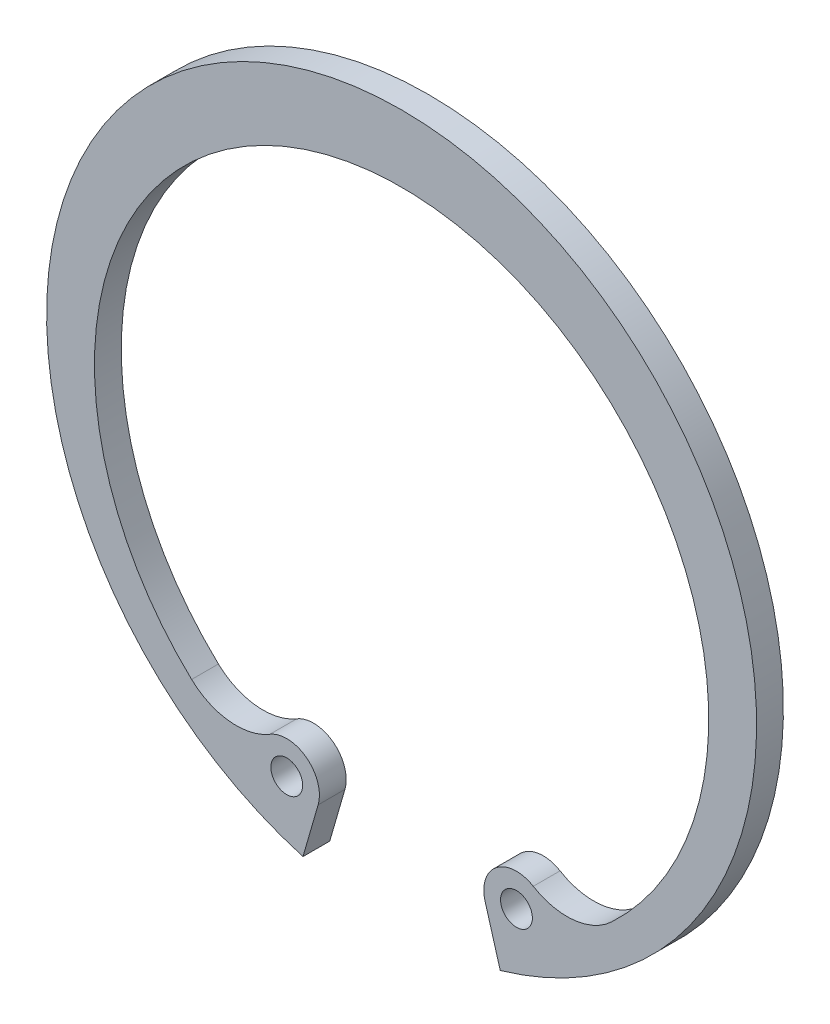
ISO-10303-21;
HEADER;
FILE_DESCRIPTION(('STEP AP214'),'2;1');
FILE_NAME('part.step','',(''),(''),'','','');
FILE_SCHEMA(('AUTOMOTIVE_DESIGN { 1 0 10303 214 1 1 1 1 }'));
ENDSEC;
DATA;
#1=APPLICATION_CONTEXT('core data for automotive mechanical design processes');
#2=APPLICATION_PROTOCOL_DEFINITION('international standard','automotive_design',2000,#1);
#3=PRODUCT_CONTEXT('',#1,'mechanical');
#4=PRODUCT('Part','Part','',(#3));
#5=PRODUCT_RELATED_PRODUCT_CATEGORY('part','',(#4));
#6=PRODUCT_DEFINITION_FORMATION('','',#4);
#7=PRODUCT_DEFINITION_CONTEXT('part definition',#1,'design');
#8=PRODUCT_DEFINITION('design','',#6,#7);
#9=PRODUCT_DEFINITION_SHAPE('','',#8);
#10=(LENGTH_UNIT() NAMED_UNIT(*) SI_UNIT(.MILLI.,.METRE.));
#11=(NAMED_UNIT(*) PLANE_ANGLE_UNIT() SI_UNIT($,.RADIAN.));
#12=(NAMED_UNIT(*) SI_UNIT($,.STERADIAN.) SOLID_ANGLE_UNIT());
#13=UNCERTAINTY_MEASURE_WITH_UNIT(LENGTH_MEASURE(1.E-05),#10,'distance_accuracy_value','');
#14=(GEOMETRIC_REPRESENTATION_CONTEXT(3) GLOBAL_UNCERTAINTY_ASSIGNED_CONTEXT((#13)) GLOBAL_UNIT_ASSIGNED_CONTEXT((#10,
#11,#12)) REPRESENTATION_CONTEXT('',''));
#15=CARTESIAN_POINT('',(0.,0.,0.));
#16=DIRECTION('',(0.,0.,1.));
#17=DIRECTION('',(1.,0.,0.));
#18=AXIS2_PLACEMENT_3D('',#15,#16,#17);
#19=CARTESIAN_POINT('',(0.,0.,-1.6));
#20=DIRECTION('',(0.,0.,1.));
#21=DIRECTION('',(1.,0.,0.));
#22=AXIS2_PLACEMENT_3D('',#19,#20,#21);
#23=CYLINDRICAL_SURFACE('',#22,21.2);
#24=CARTESIAN_POINT('',(0.,0.,0.));
#25=DIRECTION('',(0.,0.,1.));
#26=DIRECTION('',(1.,0.,0.));
#27=AXIS2_PLACEMENT_3D('',#24,#25,#26);
#28=CIRCLE('',#27,21.2);
#29=CARTESIAN_POINT('',(5.89047248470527,-20.365223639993,0.));
#30=VERTEX_POINT('',#29);
#31=CARTESIAN_POINT('',(-5.89047248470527,-20.365223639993,0.));
#32=VERTEX_POINT('',#31);
#33=EDGE_CURVE('E96',#30,#32,#28,.T.);
#34=ORIENTED_EDGE('',*,*,#33,.F.);
#35=DIRECTION('',(0.,0.,1.));
#36=VECTOR('',#35,1.);
#37=CARTESIAN_POINT('',(5.89047248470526,-20.365223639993,-1.6));
#38=LINE('',#37,#36);
#39=CARTESIAN_POINT('',(5.89047248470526,-20.365223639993,-1.6));
#40=VERTEX_POINT('',#39);
#41=EDGE_CURVE('E11',#40,#30,#38,.T.);
#42=ORIENTED_EDGE('',*,*,#41,.F.);
#43=CARTESIAN_POINT('',(0.,0.,-1.6));
#44=DIRECTION('',(0.,0.,1.));
#45=DIRECTION('',(1.,0.,0.));
#46=AXIS2_PLACEMENT_3D('',#43,#44,#45);
#47=CIRCLE('',#46,21.2);
#48=CARTESIAN_POINT('',(-5.89047248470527,-20.365223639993,-1.6));
#49=VERTEX_POINT('',#48);
#50=EDGE_CURVE('E98',#40,#49,#47,.T.);
#51=ORIENTED_EDGE('',*,*,#50,.T.);
#52=DIRECTION('',(0.,0.,1.));
#53=VECTOR('',#52,1.);
#54=CARTESIAN_POINT('',(-5.89047248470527,-20.365223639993,-1.6));
#55=LINE('',#54,#53);
#56=EDGE_CURVE('E35',#49,#32,#55,.T.);
#57=ORIENTED_EDGE('',*,*,#56,.T.);
#58=EDGE_LOOP('',(#34,#42,#51,#57));
#59=FACE_BOUND('',#58,.T.);
#60=ADVANCED_FACE('F32',(#59),#23,.T.);
#61=CARTESIAN_POINT('',(5.89047248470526,-20.365223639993,-1.6));
#62=DIRECTION('',(-0.960623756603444,-0.277852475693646,0.));
#63=DIRECTION('',(0.277852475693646,-0.960623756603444,0.));
#64=AXIS2_PLACEMENT_3D('',#61,#62,#63);
#65=PLANE('',#64);
#66=DIRECTION('',(0.277852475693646,-0.960623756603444,0.));
#67=VECTOR('',#66,1.);
#68=CARTESIAN_POINT('',(5.89047248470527,-20.365223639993,0.));
#69=LINE('',#68,#67);
#70=CARTESIAN_POINT('',(4.98588441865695,-17.2377770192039,0.));
#71=VERTEX_POINT('',#70);
#72=EDGE_CURVE('E114',#71,#30,#69,.T.);
#73=ORIENTED_EDGE('',*,*,#72,.F.);
#74=DIRECTION('',(0.,0.,1.));
#75=VECTOR('',#74,1.);
#76=CARTESIAN_POINT('',(4.98588441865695,-17.2377770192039,-1.6));
#77=LINE('',#76,#75);
#78=CARTESIAN_POINT('',(4.98588441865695,-17.2377770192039,-1.6));
#79=VERTEX_POINT('',#78);
#80=EDGE_CURVE('E40',#79,#71,#77,.T.);
#81=ORIENTED_EDGE('',*,*,#80,.F.);
#82=DIRECTION('',(0.277852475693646,-0.960623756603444,0.));
#83=VECTOR('',#82,1.);
#84=CARTESIAN_POINT('',(5.89047248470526,-20.365223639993,-1.6));
#85=LINE('',#84,#83);
#86=EDGE_CURVE('E103',#79,#40,#85,.T.);
#87=ORIENTED_EDGE('',*,*,#86,.T.);
#88=ORIENTED_EDGE('',*,*,#41,.T.);
#89=EDGE_LOOP('',(#73,#81,#87,#88));
#90=FACE_BOUND('',#89,.T.);
#91=ADVANCED_FACE('F180',(#90),#65,.T.);
#92=CARTESIAN_POINT('',(6.85910074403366,-16.6959646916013,-1.6));
#93=DIRECTION('',(0.,0.,1.));
#94=DIRECTION('',(1.,0.,0.));
#95=AXIS2_PLACEMENT_3D('',#92,#93,#94);
#96=CYLINDRICAL_SURFACE('',#95,1.95);
#97=CARTESIAN_POINT('',(6.85910074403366,-16.6959646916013,0.));
#98=DIRECTION('',(0.,0.,1.));
#99=DIRECTION('',(1.,0.,0.));
#100=AXIS2_PLACEMENT_3D('',#97,#98,#99);
#101=CIRCLE('',#100,1.95);
#102=CARTESIAN_POINT('',(7.86393036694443,-15.0247922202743,0.));
#103=VERTEX_POINT('',#102);
#104=EDGE_CURVE('E132',#103,#71,#101,.T.);
#105=ORIENTED_EDGE('',*,*,#104,.F.);
#106=DIRECTION('',(0.,0.,1.));
#107=VECTOR('',#106,1.);
#108=CARTESIAN_POINT('',(7.86393036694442,-15.0247922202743,-1.6));
#109=LINE('',#108,#107);
#110=CARTESIAN_POINT('',(7.86393036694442,-15.0247922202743,-1.6));
#111=VERTEX_POINT('',#110);
#112=EDGE_CURVE('E154',#111,#103,#109,.T.);
#113=ORIENTED_EDGE('',*,*,#112,.F.);
#114=CARTESIAN_POINT('',(6.85910074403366,-16.6959646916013,-1.6));
#115=DIRECTION('',(0.,0.,1.));
#116=DIRECTION('',(1.,0.,0.));
#117=AXIS2_PLACEMENT_3D('',#114,#115,#116);
#118=CIRCLE('',#117,1.95);
#119=EDGE_CURVE('E150',#111,#79,#118,.T.);
#120=ORIENTED_EDGE('',*,*,#119,.T.);
#121=ORIENTED_EDGE('',*,*,#80,.T.);
#122=EDGE_LOOP('',(#105,#113,#120,#121));
#123=FACE_BOUND('',#122,.T.);
#124=ADVANCED_FACE('F179',(#123),#96,.T.);
#125=CARTESIAN_POINT('',(9.87358961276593,-11.6824472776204,-1.6));
#126=DIRECTION('',(0.,0.,1.));
#127=DIRECTION('',(1.,0.,0.));
#128=AXIS2_PLACEMENT_3D('',#125,#126,#127);
#129=CYLINDRICAL_SURFACE('',#128,3.9);
#130=CARTESIAN_POINT('',(9.87358961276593,-11.6824472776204,0.));
#131=DIRECTION('',(0.,0.,-1.));
#132=DIRECTION('',(1.,0.,0.));
#133=AXIS2_PLACEMENT_3D('',#130,#131,#132);
#134=CIRCLE('',#133,3.9);
#135=CARTESIAN_POINT('',(12.5398456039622,-14.5286867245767,0.));
#136=VERTEX_POINT('',#135);
#137=EDGE_CURVE('E129',#136,#103,#134,.T.);
#138=ORIENTED_EDGE('',*,*,#137,.F.);
#139=DIRECTION('',(0.,0.,1.));
#140=VECTOR('',#139,1.);
#141=CARTESIAN_POINT('',(12.5398456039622,-14.5286867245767,-1.59999999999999));
#142=LINE('',#141,#140);
#143=CARTESIAN_POINT('',(12.5398456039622,-14.5286867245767,-1.59999999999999));
#144=VERTEX_POINT('',#143);
#145=EDGE_CURVE('E156',#144,#136,#142,.T.);
#146=ORIENTED_EDGE('',*,*,#145,.F.);
#147=CARTESIAN_POINT('',(9.87358961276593,-11.6824472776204,-1.6));
#148=DIRECTION('',(0.,0.,-1.));
#149=DIRECTION('',(1.,0.,0.));
#150=AXIS2_PLACEMENT_3D('',#147,#148,#149);
#151=CIRCLE('',#150,3.9);
#152=EDGE_CURVE('E147',#144,#111,#151,.T.);
#153=ORIENTED_EDGE('',*,*,#152,.T.);
#154=ORIENTED_EDGE('',*,*,#112,.T.);
#155=EDGE_LOOP('',(#138,#146,#153,#154));
#156=FACE_BOUND('',#155,.T.);
#157=ADVANCED_FACE('F175',(#156),#129,.F.);
#158=CARTESIAN_POINT('',(0.,-1.14234897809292,-1.6));
#159=DIRECTION('',(0.,0.,1.));
#160=DIRECTION('',(1.,0.,0.));
#161=AXIS2_PLACEMENT_3D('',#158,#159,#160);
#162=CYLINDRICAL_SURFACE('',#161,18.3423489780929);
#163=CARTESIAN_POINT('',(0.,-1.14234897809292,0.));
#164=DIRECTION('',(0.,0.,-1.));
#165=DIRECTION('',(1.,0.,0.));
#166=AXIS2_PLACEMENT_3D('',#163,#164,#165);
#167=CIRCLE('',#166,18.3423489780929);
#168=CARTESIAN_POINT('',(-12.5398456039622,-14.5286867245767,0.));
#169=VERTEX_POINT('',#168);
#170=EDGE_CURVE('E126',#169,#136,#167,.T.);
#171=ORIENTED_EDGE('',*,*,#170,.F.);
#172=DIRECTION('',(0.,0.,1.));
#173=VECTOR('',#172,1.);
#174=CARTESIAN_POINT('',(-12.5398456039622,-14.5286867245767,-1.6));
#175=LINE('',#174,#173);
#176=CARTESIAN_POINT('',(-12.5398456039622,-14.5286867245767,-1.6));
#177=VERTEX_POINT('',#176);
#178=EDGE_CURVE('E158',#177,#169,#175,.T.);
#179=ORIENTED_EDGE('',*,*,#178,.F.);
#180=CARTESIAN_POINT('',(0.,-1.14234897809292,-1.6));
#181=DIRECTION('',(0.,0.,-1.));
#182=DIRECTION('',(1.,0.,0.));
#183=AXIS2_PLACEMENT_3D('',#180,#181,#182);
#184=CIRCLE('',#183,18.3423489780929);
#185=EDGE_CURVE('E144',#177,#144,#184,.T.);
#186=ORIENTED_EDGE('',*,*,#185,.T.);
#187=ORIENTED_EDGE('',*,*,#145,.T.);
#188=EDGE_LOOP('',(#171,#179,#186,#187));
#189=FACE_BOUND('',#188,.T.);
#190=ADVANCED_FACE('F171',(#189),#162,.F.);
#191=CARTESIAN_POINT('',(-9.87358961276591,-11.6824472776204,-1.6));
#192=DIRECTION('',(0.,0.,1.));
#193=DIRECTION('',(1.,0.,0.));
#194=AXIS2_PLACEMENT_3D('',#191,#192,#193);
#195=CYLINDRICAL_SURFACE('',#194,3.9);
#196=CARTESIAN_POINT('',(-9.87358961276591,-11.6824472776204,0.));
#197=DIRECTION('',(0.,0.,-1.));
#198=DIRECTION('',(1.,0.,0.));
#199=AXIS2_PLACEMENT_3D('',#196,#197,#198);
#200=CIRCLE('',#199,3.9);
#201=CARTESIAN_POINT('',(-7.86393036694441,-15.0247922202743,0.));
#202=VERTEX_POINT('',#201);
#203=EDGE_CURVE('E123',#202,#169,#200,.T.);
#204=ORIENTED_EDGE('',*,*,#203,.F.);
#205=DIRECTION('',(0.,0.,1.));
#206=VECTOR('',#205,1.);
#207=CARTESIAN_POINT('',(-7.86393036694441,-15.0247922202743,-1.59999999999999));
#208=LINE('',#207,#206);
#209=CARTESIAN_POINT('',(-7.86393036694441,-15.0247922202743,-1.59999999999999));
#210=VERTEX_POINT('',#209);
#211=EDGE_CURVE('E160',#210,#202,#208,.T.);
#212=ORIENTED_EDGE('',*,*,#211,.F.);
#213=CARTESIAN_POINT('',(-9.87358961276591,-11.6824472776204,-1.6));
#214=DIRECTION('',(0.,0.,-1.));
#215=DIRECTION('',(1.,0.,0.));
#216=AXIS2_PLACEMENT_3D('',#213,#214,#215);
#217=CIRCLE('',#216,3.9);
#218=EDGE_CURVE('E141',#210,#177,#217,.T.);
#219=ORIENTED_EDGE('',*,*,#218,.T.);
#220=ORIENTED_EDGE('',*,*,#178,.T.);
#221=EDGE_LOOP('',(#204,#212,#219,#220));
#222=FACE_BOUND('',#221,.T.);
#223=ADVANCED_FACE('F167',(#222),#195,.F.);
#224=CARTESIAN_POINT('',(-6.85910074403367,-16.6959646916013,-1.6));
#225=DIRECTION('',(0.,0.,1.));
#226=DIRECTION('',(1.,0.,0.));
#227=AXIS2_PLACEMENT_3D('',#224,#225,#226);
#228=CYLINDRICAL_SURFACE('',#227,1.95);
#229=CARTESIAN_POINT('',(-6.85910074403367,-16.6959646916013,0.));
#230=DIRECTION('',(0.,0.,1.));
#231=DIRECTION('',(1.,0.,0.));
#232=AXIS2_PLACEMENT_3D('',#229,#230,#231);
#233=CIRCLE('',#232,1.95);
#234=CARTESIAN_POINT('',(-4.98588441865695,-17.2377770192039,0.));
#235=VERTEX_POINT('',#234);
#236=EDGE_CURVE('E110',#235,#202,#233,.T.);
#237=ORIENTED_EDGE('',*,*,#236,.F.);
#238=DIRECTION('',(0.,0.,1.));
#239=VECTOR('',#238,1.);
#240=CARTESIAN_POINT('',(-4.98588441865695,-17.2377770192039,-1.6));
#241=LINE('',#240,#239);
#242=CARTESIAN_POINT('',(-4.98588441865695,-17.2377770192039,-1.6));
#243=VERTEX_POINT('',#242);
#244=EDGE_CURVE('E102',#243,#235,#241,.T.);
#245=ORIENTED_EDGE('',*,*,#244,.F.);
#246=CARTESIAN_POINT('',(-6.85910074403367,-16.6959646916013,-1.6));
#247=DIRECTION('',(0.,0.,1.));
#248=DIRECTION('',(1.,0.,0.));
#249=AXIS2_PLACEMENT_3D('',#246,#247,#248);
#250=CIRCLE('',#249,1.95);
#251=EDGE_CURVE('E138',#243,#210,#250,.T.);
#252=ORIENTED_EDGE('',*,*,#251,.T.);
#253=ORIENTED_EDGE('',*,*,#211,.T.);
#254=EDGE_LOOP('',(#237,#245,#252,#253));
#255=FACE_BOUND('',#254,.T.);
#256=ADVANCED_FACE('F163',(#255),#228,.T.);
#257=CARTESIAN_POINT('',(-5.89047248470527,-20.365223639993,-1.6));
#258=DIRECTION('',(0.960623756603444,-0.277852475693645,0.));
#259=DIRECTION('',(0.277852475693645,0.960623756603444,0.));
#260=AXIS2_PLACEMENT_3D('',#257,#258,#259);
#261=PLANE('',#260);
#262=DIRECTION('',(0.277852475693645,0.960623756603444,0.));
#263=VECTOR('',#262,1.);
#264=CARTESIAN_POINT('',(-5.89047248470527,-20.365223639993,0.));
#265=LINE('',#264,#263);
#266=EDGE_CURVE('E105',#32,#235,#265,.T.);
#267=ORIENTED_EDGE('',*,*,#266,.F.);
#268=ORIENTED_EDGE('',*,*,#56,.F.);
#269=DIRECTION('',(0.277852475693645,0.960623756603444,0.));
#270=VECTOR('',#269,1.);
#271=CARTESIAN_POINT('',(-5.89047248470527,-20.365223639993,-1.6));
#272=LINE('',#271,#270);
#273=EDGE_CURVE('E136',#49,#243,#272,.T.);
#274=ORIENTED_EDGE('',*,*,#273,.T.);
#275=ORIENTED_EDGE('',*,*,#244,.T.);
#276=EDGE_LOOP('',(#267,#268,#274,#275));
#277=FACE_BOUND('',#276,.T.);
#278=ADVANCED_FACE('F106',(#277),#261,.T.);
#279=CARTESIAN_POINT('',(0.,0.,-1.6));
#280=DIRECTION('',(0.,0.,1.));
#281=DIRECTION('',(1.,0.,0.));
#282=AXIS2_PLACEMENT_3D('',#279,#280,#281);
#283=PLANE('',#282);
#284=CARTESIAN_POINT('',(-6.85910074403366,-16.6959646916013,-1.6));
#285=DIRECTION('',(0.,0.,1.));
#286=DIRECTION('',(1.,0.,0.));
#287=AXIS2_PLACEMENT_3D('',#284,#285,#286);
#288=CIRCLE('',#287,0.95);
#289=CARTESIAN_POINT('',(-5.90910074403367,-16.6959646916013,-1.6));
#290=VERTEX_POINT('',#289);
#291=EDGE_CURVE('E256',#290,#290,#288,.T.);
#292=ORIENTED_EDGE('',*,*,#291,.T.);
#293=EDGE_LOOP('',(#292));
#294=FACE_BOUND('',#293,.T.);
#295=CARTESIAN_POINT('',(6.85910074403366,-16.6959646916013,-1.6));
#296=DIRECTION('',(0.,0.,1.));
#297=DIRECTION('',(1.,0.,0.));
#298=AXIS2_PLACEMENT_3D('',#295,#296,#297);
#299=CIRCLE('',#298,0.95);
#300=CARTESIAN_POINT('',(7.80910074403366,-16.6959646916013,-1.6));
#301=VERTEX_POINT('',#300);
#302=EDGE_CURVE('E115',#301,#301,#299,.T.);
#303=ORIENTED_EDGE('',*,*,#302,.T.);
#304=EDGE_LOOP('',(#303));
#305=FACE_BOUND('',#304,.T.);
#306=ORIENTED_EDGE('',*,*,#50,.F.);
#307=ORIENTED_EDGE('',*,*,#86,.F.);
#308=ORIENTED_EDGE('',*,*,#119,.F.);
#309=ORIENTED_EDGE('',*,*,#152,.F.);
#310=ORIENTED_EDGE('',*,*,#185,.F.);
#311=ORIENTED_EDGE('',*,*,#218,.F.);
#312=ORIENTED_EDGE('',*,*,#251,.F.);
#313=ORIENTED_EDGE('',*,*,#273,.F.);
#314=EDGE_LOOP('',(#306,#307,#308,#309,#310,#311,#312,#313));
#315=FACE_BOUND('',#314,.T.);
#316=ADVANCED_FACE('F183',(#294,#305,#315),#283,.F.);
#317=CARTESIAN_POINT('',(0.,0.,0.));
#318=DIRECTION('',(0.,0.,1.));
#319=DIRECTION('',(1.,0.,0.));
#320=AXIS2_PLACEMENT_3D('',#317,#318,#319);
#321=PLANE('',#320);
#322=CARTESIAN_POINT('',(-6.85910074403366,-16.6959646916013,0.));
#323=DIRECTION('',(0.,0.,1.));
#324=DIRECTION('',(1.,0.,0.));
#325=AXIS2_PLACEMENT_3D('',#322,#323,#324);
#326=CIRCLE('',#325,0.95);
#327=CARTESIAN_POINT('',(-5.90910074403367,-16.6959646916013,0.));
#328=VERTEX_POINT('',#327);
#329=EDGE_CURVE('E259',#328,#328,#326,.T.);
#330=ORIENTED_EDGE('',*,*,#329,.F.);
#331=EDGE_LOOP('',(#330));
#332=FACE_BOUND('',#331,.T.);
#333=CARTESIAN_POINT('',(6.85910074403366,-16.6959646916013,0.));
#334=DIRECTION('',(0.,0.,1.));
#335=DIRECTION('',(1.,0.,0.));
#336=AXIS2_PLACEMENT_3D('',#333,#334,#335);
#337=CIRCLE('',#336,0.95);
#338=CARTESIAN_POINT('',(7.80910074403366,-16.6959646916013,0.));
#339=VERTEX_POINT('',#338);
#340=EDGE_CURVE('E118',#339,#339,#337,.T.);
#341=ORIENTED_EDGE('',*,*,#340,.F.);
#342=EDGE_LOOP('',(#341));
#343=FACE_BOUND('',#342,.T.);
#344=ORIENTED_EDGE('',*,*,#33,.T.);
#345=ORIENTED_EDGE('',*,*,#266,.T.);
#346=ORIENTED_EDGE('',*,*,#236,.T.);
#347=ORIENTED_EDGE('',*,*,#203,.T.);
#348=ORIENTED_EDGE('',*,*,#170,.T.);
#349=ORIENTED_EDGE('',*,*,#137,.T.);
#350=ORIENTED_EDGE('',*,*,#104,.T.);
#351=ORIENTED_EDGE('',*,*,#72,.T.);
#352=EDGE_LOOP('',(#344,#345,#346,#347,#348,#349,#350,#351));
#353=FACE_BOUND('',#352,.T.);
#354=ADVANCED_FACE('F112',(#332,#343,#353),#321,.T.);
#355=CARTESIAN_POINT('',(6.85910074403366,-16.6959646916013,-1.6));
#356=DIRECTION('',(0.,0.,1.));
#357=DIRECTION('',(1.,0.,0.));
#358=AXIS2_PLACEMENT_3D('',#355,#356,#357);
#359=CYLINDRICAL_SURFACE('',#358,0.95);
#360=ORIENTED_EDGE('',*,*,#302,.F.);
#361=EDGE_LOOP('',(#360));
#362=FACE_BOUND('',#361,.T.);
#363=ORIENTED_EDGE('',*,*,#340,.T.);
#364=EDGE_LOOP('',(#363));
#365=FACE_BOUND('',#364,.T.);
#366=ADVANCED_FACE('F191',(#362,#365),#359,.F.);
#367=CARTESIAN_POINT('',(-6.85910074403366,-16.6959646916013,-1.6));
#368=DIRECTION('',(0.,0.,1.));
#369=DIRECTION('',(1.,0.,0.));
#370=AXIS2_PLACEMENT_3D('',#367,#368,#369);
#371=CYLINDRICAL_SURFACE('',#370,0.95);
#372=ORIENTED_EDGE('',*,*,#291,.F.);
#373=EDGE_LOOP('',(#372));
#374=FACE_BOUND('',#373,.T.);
#375=ORIENTED_EDGE('',*,*,#329,.T.);
#376=EDGE_LOOP('',(#375));
#377=FACE_BOUND('',#376,.T.);
#378=ADVANCED_FACE('F240',(#374,#377),#371,.F.);
#379=CLOSED_SHELL('',(#60,#91,#124,#157,#190,#223,#256,#278,#316,#354,#366,#378));
#380=MANIFOLD_SOLID_BREP('B2',#379);
#381=ADVANCED_BREP_SHAPE_REPRESENTATION('',(#18,#380),#14);
#382=SHAPE_DEFINITION_REPRESENTATION(#9,#381);
ENDSEC;
END-ISO-10303-21;
